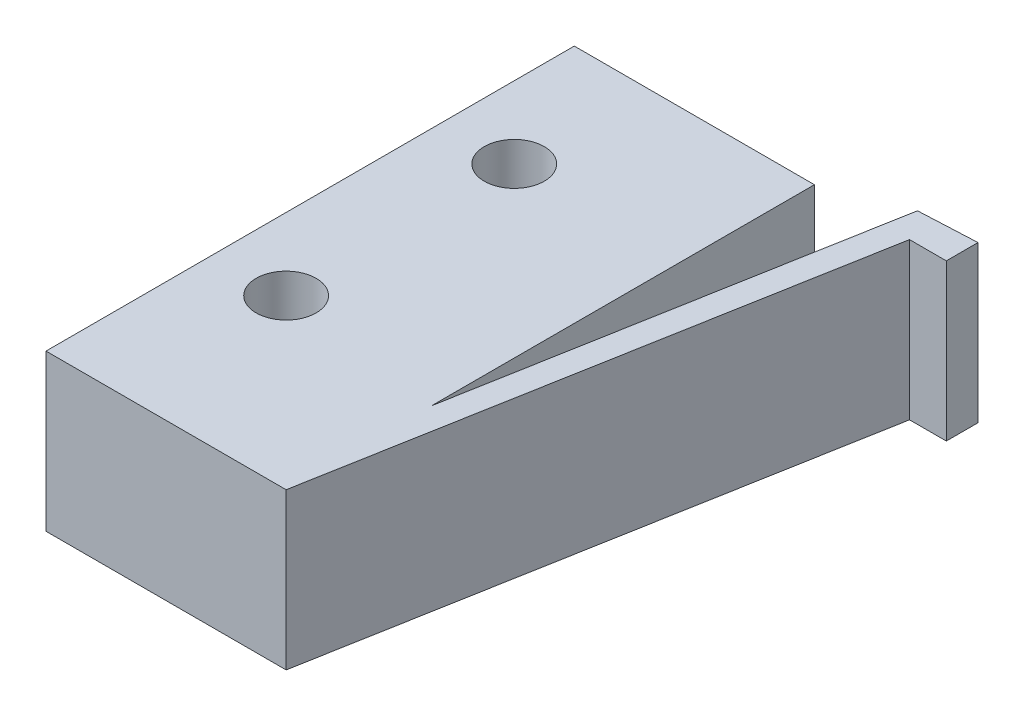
from build123d import *

# Parameters (mm, degrees)
SKETCH1_W           = 10
SKETCH1_H           = 22
SKETCH1_R           = 1.25
BOSS_EXTRUDE1_DEPTH = 3.25
BOSS_EXTRUDE2_DEPTH = 6.5


with BuildPart() as part:
    # Sketch1 → Boss-Extrude1 (new, symmetric)
    with BuildSketch(Plane(origin=(0, 0, 0), x_dir=(1, 0, 0), z_dir=(0, 1, 0))):
        Rectangle(SKETCH1_W, SKETCH1_H)
        with Locations(Location((-2, 5.5, 0), (0, 0, 90))):
            Circle(SKETCH1_R, mode=Mode.SUBTRACT)
        with Locations(Location((-2, -4, 0), (0, 0, 90))):
            Circle(SKETCH1_R, mode=Mode.SUBTRACT)
    extrude(amount=BOSS_EXTRUDE1_DEPTH, both=True)

    # Sketch3 → Boss-Extrude2 (add)
    with BuildSketch(Plane(origin=(0, 3.25, 0), x_dir=(1, 0, 0), z_dir=(0, 1, 0))):
        Polygon((5, -11), (8.959839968, 11), (10.491770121, 11), (10.491770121, 12.319636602), (8.086804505, 12.204330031), (4.913627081, -5.425145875), align=None)
    extrude(amount=-BOSS_EXTRUDE2_DEPTH)


solid = part.part
